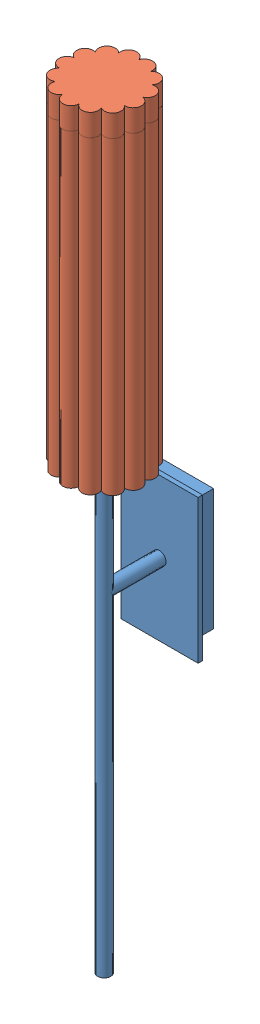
SolidWorks assembly BARRA_APLIQUE.SLDASM, configuration Predeterminado (file format 11000). Lengths in mm.
Overall size (74.68 700 111.56).
2 component instances, 2 part files, 2 mates.
Components (placement in the parent):
- Base_Aplique-1: Base_Aplique.SLDPRT [Predeterminado] at origin size (70 400 80)
- barra_A-1: barra_A.SLDPRT [Predeterminado] at (0 100 54) x (0 -1 0) z (0.999999 0 -0.001566) size (300 74.13 74.56)
Mates (geometry in assembly coordinates):
- Coincidente1: coincident: plane of assembly; plane of assembly; plane of Base_Aplique-1 through (0 100 54) normal (0 1 0); plane of barra_A-1 through (7.0151 100 82.2709) normal (0 -1 0)
- Concéntrica1: concentric: circle of assembly; circle of assembly; circle of Base_Aplique-1; circle of barra_A-1
